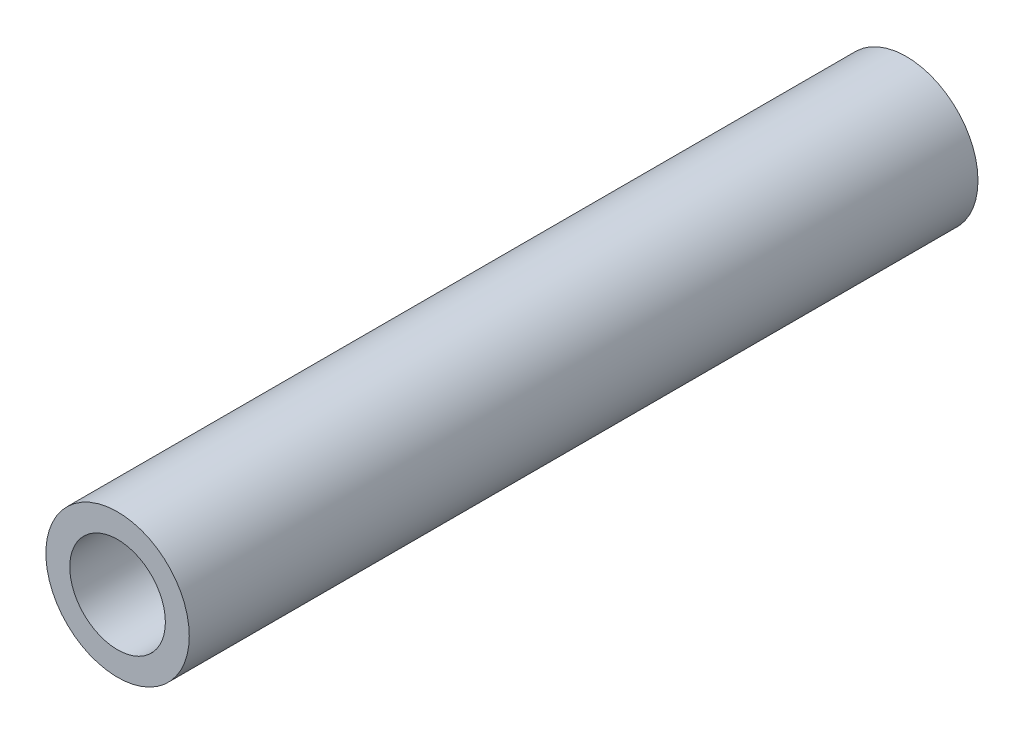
from build123d import *

# Parameters (mm, degrees)
ESQUISSE1_R             = 3
EXTRUSION1_DEPTH        = 33
ESQUISSE2_R             = 2
ENL_V_MAT_EXTRU_1_DEPTH = 11


with BuildPart() as part:
    # Esquisse1 → Extrusion1 (new body)
    with BuildSketch(Plane.XY):
        Circle(ESQUISSE1_R)
    extrude(amount=EXTRUSION1_DEPTH)

    # Esquisse2 → Enl_v. mat.-Extru.1 (cut)
    with BuildSketch(Plane.XY.offset(33)):
        Circle(ESQUISSE2_R)
    extrude(amount=-ENL_V_MAT_EXTRU_1_DEPTH, mode=Mode.SUBTRACT)

    # Esquisse3 → Enl_vement de mati_re-R_volution1 (revolve, cut)
    with BuildSketch(Plane(origin=(0, 0, 0), x_dir=(0, 0, -1), z_dir=(1, 0, 0)), mode=Mode.PRIVATE) as enl_vement_de_mati_re_r_volution1_sk:
        Polygon((-22.126639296, 0), (-22, -2), (-21.008196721, 0), align=None)
    revolve(enl_vement_de_mati_re_r_volution1_sk.sketch.rotate(Axis((0, 0, 24.865209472), (0, 0, -1)), 270), axis=Axis((0, 0, 24.865209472), (0, 0, -1)), mode=Mode.SUBTRACT)


solid = part.part
